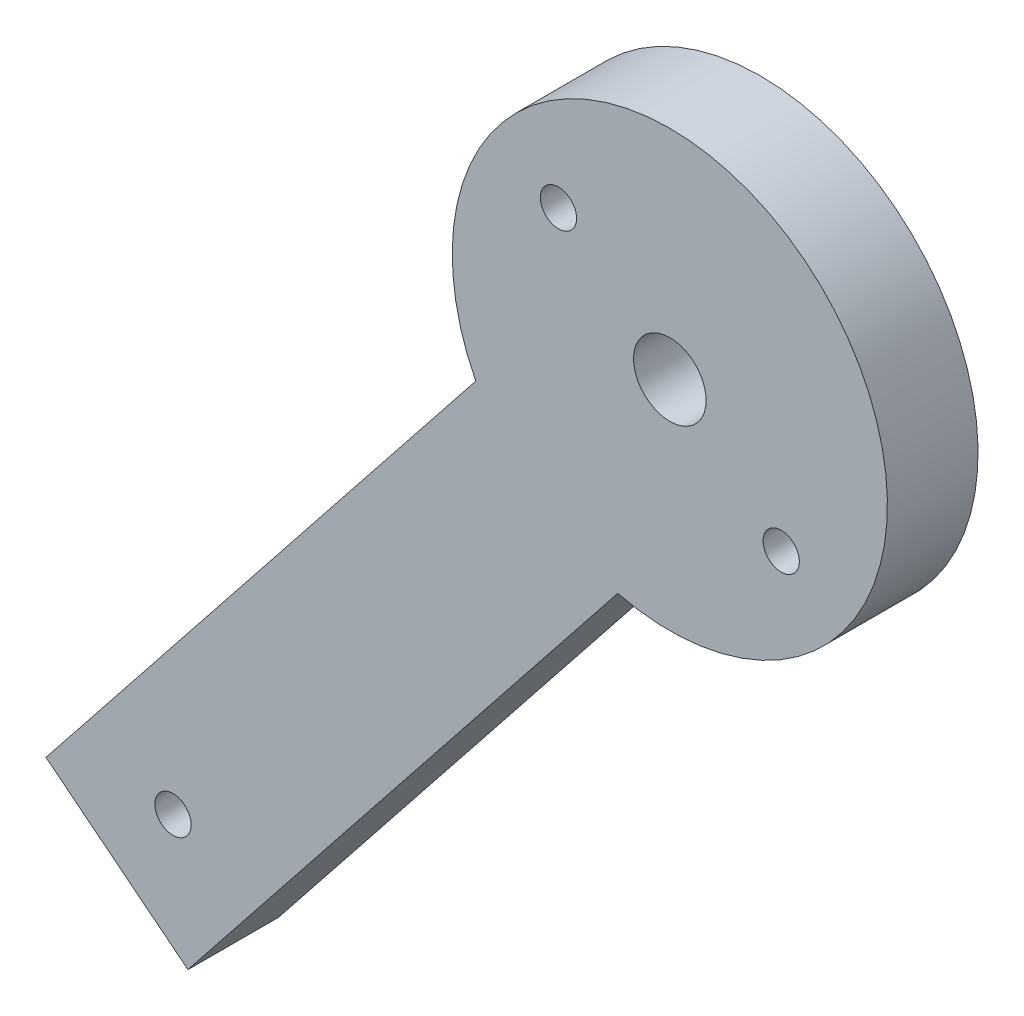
ISO-10303-21;
HEADER;
FILE_DESCRIPTION(('STEP AP214'),'2;1');
FILE_NAME('part.step','',(''),(''),'','','');
FILE_SCHEMA(('AUTOMOTIVE_DESIGN { 1 0 10303 214 1 1 1 1 }'));
ENDSEC;
DATA;
#1=APPLICATION_CONTEXT('core data for automotive mechanical design processes');
#2=APPLICATION_PROTOCOL_DEFINITION('international standard','automotive_design',2000,#1);
#3=PRODUCT_CONTEXT('',#1,'mechanical');
#4=PRODUCT('Part','Part','',(#3));
#5=PRODUCT_RELATED_PRODUCT_CATEGORY('part','',(#4));
#6=PRODUCT_DEFINITION_FORMATION('','',#4);
#7=PRODUCT_DEFINITION_CONTEXT('part definition',#1,'design');
#8=PRODUCT_DEFINITION('design','',#6,#7);
#9=PRODUCT_DEFINITION_SHAPE('','',#8);
#10=(LENGTH_UNIT() NAMED_UNIT(*) SI_UNIT(.MILLI.,.METRE.));
#11=(NAMED_UNIT(*) PLANE_ANGLE_UNIT() SI_UNIT($,.RADIAN.));
#12=(NAMED_UNIT(*) SI_UNIT($,.STERADIAN.) SOLID_ANGLE_UNIT());
#13=UNCERTAINTY_MEASURE_WITH_UNIT(LENGTH_MEASURE(1.E-05),#10,'distance_accuracy_value','');
#14=(GEOMETRIC_REPRESENTATION_CONTEXT(3) GLOBAL_UNCERTAINTY_ASSIGNED_CONTEXT((#13)) GLOBAL_UNIT_ASSIGNED_CONTEXT((#10,
#11,#12)) REPRESENTATION_CONTEXT('',''));
#15=CARTESIAN_POINT('',(0.,0.,0.));
#16=DIRECTION('',(0.,0.,1.));
#17=DIRECTION('',(1.,0.,0.));
#18=AXIS2_PLACEMENT_3D('',#15,#16,#17);
#19=CARTESIAN_POINT('',(-34.4027260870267,-35.248438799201,5.));
#20=DIRECTION('',(0.622214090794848,0.782847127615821,0.));
#21=DIRECTION('',(-0.782847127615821,0.622214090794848,0.));
#22=AXIS2_PLACEMENT_3D('',#19,#20,#21);
#23=PLANE('',#22);
#24=DIRECTION('',(0.782847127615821,-0.622214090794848,0.));
#25=VECTOR('',#24,1.);
#26=CARTESIAN_POINT('',(-34.4027260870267,-35.248438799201,0.));
#27=LINE('',#26,#25);
#28=CARTESIAN_POINT('',(-34.4027260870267,-35.248438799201,0.));
#29=VERTEX_POINT('',#28);
#30=CARTESIAN_POINT('',(-26.5742548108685,-41.4705797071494,0.));
#31=VERTEX_POINT('',#30);
#32=EDGE_CURVE('E96',#29,#31,#27,.T.);
#33=ORIENTED_EDGE('',*,*,#32,.T.);
#34=DIRECTION('',(0.,0.,-1.));
#35=VECTOR('',#34,1.);
#36=CARTESIAN_POINT('',(-26.5742548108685,-41.4705797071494,5.));
#37=LINE('',#36,#35);
#38=CARTESIAN_POINT('',(-26.5742548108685,-41.4705797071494,5.));
#39=VERTEX_POINT('',#38);
#40=EDGE_CURVE('E11',#39,#31,#37,.T.);
#41=ORIENTED_EDGE('',*,*,#40,.F.);
#42=DIRECTION('',(0.782847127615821,-0.622214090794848,0.));
#43=VECTOR('',#42,1.);
#44=CARTESIAN_POINT('',(-34.4027260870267,-35.248438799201,5.));
#45=LINE('',#44,#43);
#46=CARTESIAN_POINT('',(-34.4027260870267,-35.248438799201,5.));
#47=VERTEX_POINT('',#46);
#48=EDGE_CURVE('E84',#47,#39,#45,.T.);
#49=ORIENTED_EDGE('',*,*,#48,.F.);
#50=DIRECTION('',(0.,0.,-1.));
#51=VECTOR('',#50,1.);
#52=CARTESIAN_POINT('',(-34.4027260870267,-35.248438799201,5.));
#53=LINE('',#52,#51);
#54=EDGE_CURVE('E92',#47,#29,#53,.T.);
#55=ORIENTED_EDGE('',*,*,#54,.T.);
#56=EDGE_LOOP('',(#33,#41,#49,#55));
#57=FACE_BOUND('',#56,.T.);
#58=ADVANCED_FACE('F33',(#57),#23,.F.);
#59=CARTESIAN_POINT('',(-26.5742548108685,-41.4705797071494,5.));
#60=DIRECTION('',(-0.78284712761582,0.622214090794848,0.));
#61=DIRECTION('',(-0.622214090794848,-0.78284712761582,0.));
#62=AXIS2_PLACEMENT_3D('',#59,#60,#61);
#63=PLANE('',#62);
#64=DIRECTION('',(0.622214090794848,0.78284712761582,0.));
#65=VECTOR('',#64,1.);
#66=CARTESIAN_POINT('',(-26.5742548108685,-41.4705797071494,0.));
#67=LINE('',#66,#65);
#68=CARTESIAN_POINT('',(-2.87331875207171,-11.6509243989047,0.));
#69=VERTEX_POINT('',#68);
#70=EDGE_CURVE('E88',#31,#69,#67,.T.);
#71=ORIENTED_EDGE('',*,*,#70,.T.);
#72=DIRECTION('',(0.,0.,-1.));
#73=VECTOR('',#72,1.);
#74=CARTESIAN_POINT('',(-2.87331875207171,-11.6509243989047,5.));
#75=LINE('',#74,#73);
#76=CARTESIAN_POINT('',(-2.87331875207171,-11.6509243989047,5.));
#77=VERTEX_POINT('',#76);
#78=EDGE_CURVE('E41',#77,#69,#75,.T.);
#79=ORIENTED_EDGE('',*,*,#78,.F.);
#80=DIRECTION('',(0.622214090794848,0.78284712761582,0.));
#81=VECTOR('',#80,1.);
#82=CARTESIAN_POINT('',(-26.5742548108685,-41.4705797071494,5.));
#83=LINE('',#82,#81);
#84=EDGE_CURVE('E79',#39,#77,#83,.T.);
#85=ORIENTED_EDGE('',*,*,#84,.F.);
#86=ORIENTED_EDGE('',*,*,#40,.T.);
#87=EDGE_LOOP('',(#71,#79,#85,#86));
#88=FACE_BOUND('',#87,.T.);
#89=ADVANCED_FACE('F87',(#88),#63,.F.);
#90=CARTESIAN_POINT('',(0.,0.,5.));
#91=DIRECTION('',(0.,0.,-1.));
#92=DIRECTION('',(-1.,0.,0.));
#93=AXIS2_PLACEMENT_3D('',#90,#91,#92);
#94=CYLINDRICAL_SURFACE('',#93,12.);
#95=CARTESIAN_POINT('',(0.,0.,0.));
#96=DIRECTION('',(0.,0.,1.));
#97=DIRECTION('',(1.,0.,0.));
#98=AXIS2_PLACEMENT_3D('',#95,#96,#97);
#99=CIRCLE('',#98,12.);
#100=CARTESIAN_POINT('',(-10.7017900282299,-5.42878349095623,0.));
#101=VERTEX_POINT('',#100);
#102=EDGE_CURVE('E66',#69,#101,#99,.T.);
#103=ORIENTED_EDGE('',*,*,#102,.T.);
#104=DIRECTION('',(0.,0.,-1.));
#105=VECTOR('',#104,1.);
#106=CARTESIAN_POINT('',(-10.7017900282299,-5.42878349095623,5.));
#107=LINE('',#106,#105);
#108=CARTESIAN_POINT('',(-10.7017900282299,-5.42878349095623,5.));
#109=VERTEX_POINT('',#108);
#110=EDGE_CURVE('E89',#109,#101,#107,.T.);
#111=ORIENTED_EDGE('',*,*,#110,.F.);
#112=CARTESIAN_POINT('',(0.,0.,5.));
#113=DIRECTION('',(0.,0.,1.));
#114=DIRECTION('',(1.,0.,0.));
#115=AXIS2_PLACEMENT_3D('',#112,#113,#114);
#116=CIRCLE('',#115,12.);
#117=EDGE_CURVE('E82',#77,#109,#116,.T.);
#118=ORIENTED_EDGE('',*,*,#117,.F.);
#119=ORIENTED_EDGE('',*,*,#78,.T.);
#120=EDGE_LOOP('',(#103,#111,#118,#119));
#121=FACE_BOUND('',#120,.T.);
#122=ADVANCED_FACE('F90',(#121),#94,.T.);
#123=CARTESIAN_POINT('',(-10.7017900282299,-5.42878349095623,5.));
#124=DIRECTION('',(0.78284712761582,-0.622214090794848,0.));
#125=DIRECTION('',(0.622214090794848,0.78284712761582,0.));
#126=AXIS2_PLACEMENT_3D('',#123,#124,#125);
#127=PLANE('',#126);
#128=DIRECTION('',(-0.622214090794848,-0.78284712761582,0.));
#129=VECTOR('',#128,1.);
#130=CARTESIAN_POINT('',(-10.7017900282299,-5.42878349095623,0.));
#131=LINE('',#130,#129);
#132=EDGE_CURVE('E72',#101,#29,#131,.T.);
#133=ORIENTED_EDGE('',*,*,#132,.T.);
#134=ORIENTED_EDGE('',*,*,#54,.F.);
#135=DIRECTION('',(-0.622214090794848,-0.78284712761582,0.));
#136=VECTOR('',#135,1.);
#137=CARTESIAN_POINT('',(-10.7017900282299,-5.42878349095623,5.));
#138=LINE('',#137,#136);
#139=EDGE_CURVE('E49',#109,#47,#138,.T.);
#140=ORIENTED_EDGE('',*,*,#139,.F.);
#141=ORIENTED_EDGE('',*,*,#110,.T.);
#142=EDGE_LOOP('',(#133,#134,#140,#141));
#143=FACE_BOUND('',#142,.T.);
#144=ADVANCED_FACE('F104',(#143),#127,.F.);
#145=CARTESIAN_POINT('',(0.,0.,5.));
#146=DIRECTION('',(0.,0.,1.));
#147=DIRECTION('',(1.,0.,0.));
#148=AXIS2_PLACEMENT_3D('',#145,#146,#147);
#149=PLANE('',#148);
#150=CARTESIAN_POINT('',(-6.14179704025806,5.12623927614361,5.));
#151=DIRECTION('',(0.,0.,1.));
#152=DIRECTION('',(1.,0.,0.));
#153=AXIS2_PLACEMENT_3D('',#150,#151,#152);
#154=CIRCLE('',#153,1.);
#155=CARTESIAN_POINT('',(-5.14179704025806,5.12623927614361,5.));
#156=VERTEX_POINT('',#155);
#157=EDGE_CURVE('E128',#156,#156,#154,.T.);
#158=ORIENTED_EDGE('',*,*,#157,.F.);
#159=EDGE_LOOP('',(#158));
#160=FACE_BOUND('',#159,.T.);
#161=CARTESIAN_POINT('',(6.1417970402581,-5.12623927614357,5.));
#162=DIRECTION('',(0.,0.,1.));
#163=DIRECTION('',(1.,0.,0.));
#164=AXIS2_PLACEMENT_3D('',#161,#162,#163);
#165=CIRCLE('',#164,1.);
#166=CARTESIAN_POINT('',(7.1417970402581,-5.12623927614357,5.));
#167=VERTEX_POINT('',#166);
#168=EDGE_CURVE('E122',#167,#167,#165,.T.);
#169=ORIENTED_EDGE('',*,*,#168,.F.);
#170=EDGE_LOOP('',(#169));
#171=FACE_BOUND('',#170,.T.);
#172=CARTESIAN_POINT('',(-27.3979530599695,-34.4711075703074,5.));
#173=DIRECTION('',(0.,0.,1.));
#174=DIRECTION('',(1.,0.,0.));
#175=AXIS2_PLACEMENT_3D('',#172,#173,#174);
#176=CIRCLE('',#175,1.);
#177=CARTESIAN_POINT('',(-26.3979530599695,-34.4711075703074,5.));
#178=VERTEX_POINT('',#177);
#179=EDGE_CURVE('E116',#178,#178,#176,.T.);
#180=ORIENTED_EDGE('',*,*,#179,.F.);
#181=EDGE_LOOP('',(#180));
#182=FACE_BOUND('',#181,.T.);
#183=CARTESIAN_POINT('',(0.,0.,5.));
#184=DIRECTION('',(0.,0.,1.));
#185=DIRECTION('',(1.,0.,0.));
#186=AXIS2_PLACEMENT_3D('',#183,#184,#185);
#187=CIRCLE('',#186,2.);
#188=CARTESIAN_POINT('',(2.,0.,5.));
#189=VERTEX_POINT('',#188);
#190=EDGE_CURVE('E110',#189,#189,#187,.T.);
#191=ORIENTED_EDGE('',*,*,#190,.F.);
#192=EDGE_LOOP('',(#191));
#193=FACE_BOUND('',#192,.T.);
#194=ORIENTED_EDGE('',*,*,#48,.T.);
#195=ORIENTED_EDGE('',*,*,#84,.T.);
#196=ORIENTED_EDGE('',*,*,#117,.T.);
#197=ORIENTED_EDGE('',*,*,#139,.T.);
#198=EDGE_LOOP('',(#194,#195,#196,#197));
#199=FACE_BOUND('',#198,.T.);
#200=ADVANCED_FACE('F80',(#160,#171,#182,#193,#199),#149,.T.);
#201=CARTESIAN_POINT('',(0.,0.,0.));
#202=DIRECTION('',(0.,0.,1.));
#203=DIRECTION('',(1.,0.,0.));
#204=AXIS2_PLACEMENT_3D('',#201,#202,#203);
#205=PLANE('',#204);
#206=CARTESIAN_POINT('',(-6.14179704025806,5.12623927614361,0.));
#207=DIRECTION('',(0.,0.,1.));
#208=DIRECTION('',(1.,0.,0.));
#209=AXIS2_PLACEMENT_3D('',#206,#207,#208);
#210=CIRCLE('',#209,1.);
#211=CARTESIAN_POINT('',(-5.14179704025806,5.12623927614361,0.));
#212=VERTEX_POINT('',#211);
#213=EDGE_CURVE('E125',#212,#212,#210,.T.);
#214=ORIENTED_EDGE('',*,*,#213,.T.);
#215=EDGE_LOOP('',(#214));
#216=FACE_BOUND('',#215,.T.);
#217=CARTESIAN_POINT('',(6.1417970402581,-5.12623927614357,0.));
#218=DIRECTION('',(0.,0.,1.));
#219=DIRECTION('',(1.,0.,0.));
#220=AXIS2_PLACEMENT_3D('',#217,#218,#219);
#221=CIRCLE('',#220,1.);
#222=CARTESIAN_POINT('',(7.1417970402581,-5.12623927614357,0.));
#223=VERTEX_POINT('',#222);
#224=EDGE_CURVE('E119',#223,#223,#221,.T.);
#225=ORIENTED_EDGE('',*,*,#224,.T.);
#226=EDGE_LOOP('',(#225));
#227=FACE_BOUND('',#226,.T.);
#228=CARTESIAN_POINT('',(-27.3979530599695,-34.4711075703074,0.));
#229=DIRECTION('',(0.,0.,1.));
#230=DIRECTION('',(1.,0.,0.));
#231=AXIS2_PLACEMENT_3D('',#228,#229,#230);
#232=CIRCLE('',#231,1.);
#233=CARTESIAN_POINT('',(-26.3979530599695,-34.4711075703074,0.));
#234=VERTEX_POINT('',#233);
#235=EDGE_CURVE('E113',#234,#234,#232,.T.);
#236=ORIENTED_EDGE('',*,*,#235,.T.);
#237=EDGE_LOOP('',(#236));
#238=FACE_BOUND('',#237,.T.);
#239=CARTESIAN_POINT('',(0.,0.,0.));
#240=DIRECTION('',(0.,0.,1.));
#241=DIRECTION('',(1.,0.,0.));
#242=AXIS2_PLACEMENT_3D('',#239,#240,#241);
#243=CIRCLE('',#242,2.);
#244=CARTESIAN_POINT('',(2.,0.,0.));
#245=VERTEX_POINT('',#244);
#246=EDGE_CURVE('E99',#245,#245,#243,.T.);
#247=ORIENTED_EDGE('',*,*,#246,.T.);
#248=EDGE_LOOP('',(#247));
#249=FACE_BOUND('',#248,.T.);
#250=ORIENTED_EDGE('',*,*,#32,.F.);
#251=ORIENTED_EDGE('',*,*,#132,.F.);
#252=ORIENTED_EDGE('',*,*,#102,.F.);
#253=ORIENTED_EDGE('',*,*,#70,.F.);
#254=EDGE_LOOP('',(#250,#251,#252,#253));
#255=FACE_BOUND('',#254,.T.);
#256=ADVANCED_FACE('F107',(#216,#227,#238,#249,#255),#205,.F.);
#257=CARTESIAN_POINT('',(0.,0.,0.));
#258=DIRECTION('',(0.,0.,1.));
#259=DIRECTION('',(1.,0.,0.));
#260=AXIS2_PLACEMENT_3D('',#257,#258,#259);
#261=CYLINDRICAL_SURFACE('',#260,2.);
#262=ORIENTED_EDGE('',*,*,#246,.F.);
#263=EDGE_LOOP('',(#262));
#264=FACE_BOUND('',#263,.T.);
#265=ORIENTED_EDGE('',*,*,#190,.T.);
#266=EDGE_LOOP('',(#265));
#267=FACE_BOUND('',#266,.T.);
#268=ADVANCED_FACE('F152',(#264,#267),#261,.F.);
#269=CARTESIAN_POINT('',(-27.3979530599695,-34.4711075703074,0.));
#270=DIRECTION('',(0.,0.,1.));
#271=DIRECTION('',(1.,0.,0.));
#272=AXIS2_PLACEMENT_3D('',#269,#270,#271);
#273=CYLINDRICAL_SURFACE('',#272,1.);
#274=ORIENTED_EDGE('',*,*,#235,.F.);
#275=EDGE_LOOP('',(#274));
#276=FACE_BOUND('',#275,.T.);
#277=ORIENTED_EDGE('',*,*,#179,.T.);
#278=EDGE_LOOP('',(#277));
#279=FACE_BOUND('',#278,.T.);
#280=ADVANCED_FACE('F154',(#276,#279),#273,.F.);
#281=CARTESIAN_POINT('',(6.1417970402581,-5.12623927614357,0.));
#282=DIRECTION('',(0.,0.,1.));
#283=DIRECTION('',(1.,0.,0.));
#284=AXIS2_PLACEMENT_3D('',#281,#282,#283);
#285=CYLINDRICAL_SURFACE('',#284,1.);
#286=ORIENTED_EDGE('',*,*,#224,.F.);
#287=EDGE_LOOP('',(#286));
#288=FACE_BOUND('',#287,.T.);
#289=ORIENTED_EDGE('',*,*,#168,.T.);
#290=EDGE_LOOP('',(#289));
#291=FACE_BOUND('',#290,.T.);
#292=ADVANCED_FACE('F139',(#288,#291),#285,.F.);
#293=CARTESIAN_POINT('',(-6.14179704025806,5.12623927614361,0.));
#294=DIRECTION('',(0.,0.,1.));
#295=DIRECTION('',(1.,0.,0.));
#296=AXIS2_PLACEMENT_3D('',#293,#294,#295);
#297=CYLINDRICAL_SURFACE('',#296,1.);
#298=ORIENTED_EDGE('',*,*,#213,.F.);
#299=EDGE_LOOP('',(#298));
#300=FACE_BOUND('',#299,.T.);
#301=ORIENTED_EDGE('',*,*,#157,.T.);
#302=EDGE_LOOP('',(#301));
#303=FACE_BOUND('',#302,.T.);
#304=ADVANCED_FACE('F136',(#300,#303),#297,.F.);
#305=CLOSED_SHELL('',(#58,#89,#122,#144,#200,#256,#268,#280,#292,#304));
#306=MANIFOLD_SOLID_BREP('B2',#305);
#307=ADVANCED_BREP_SHAPE_REPRESENTATION('',(#18,#306),#14);
#308=SHAPE_DEFINITION_REPRESENTATION(#9,#307);
ENDSEC;
END-ISO-10303-21;
